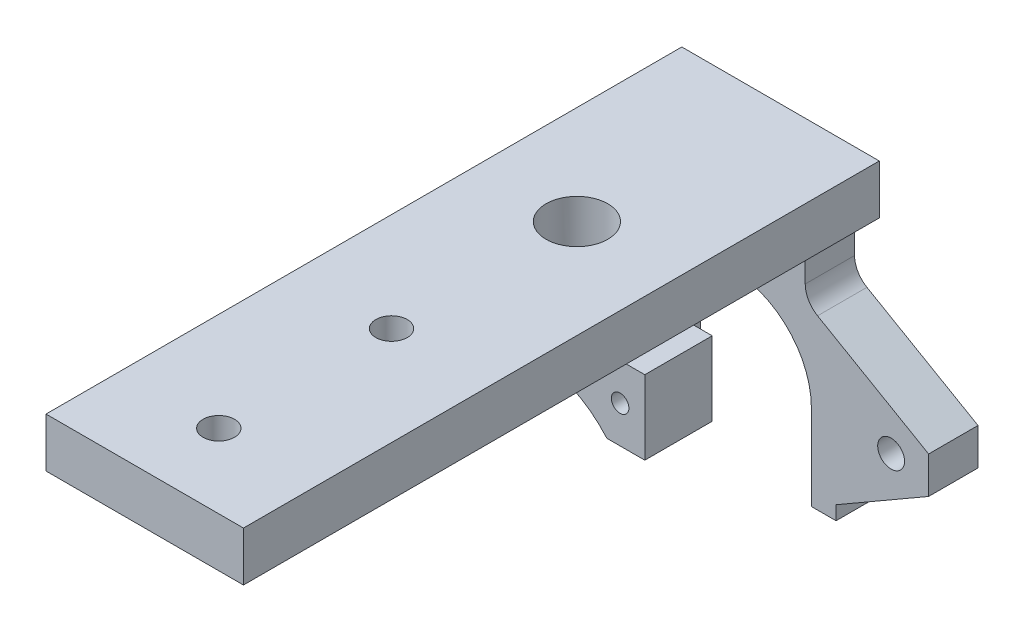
ISO-10303-21;
HEADER;
FILE_DESCRIPTION(('STEP AP214'),'2;1');
FILE_NAME('part.step','',(''),(''),'','','');
FILE_SCHEMA(('AUTOMOTIVE_DESIGN { 1 0 10303 214 1 1 1 1 }'));
ENDSEC;
DATA;
#1=APPLICATION_CONTEXT('core data for automotive mechanical design processes');
#2=APPLICATION_PROTOCOL_DEFINITION('international standard','automotive_design',2000,#1);
#3=PRODUCT_CONTEXT('',#1,'mechanical');
#4=PRODUCT('Part','Part','',(#3));
#5=PRODUCT_RELATED_PRODUCT_CATEGORY('part','',(#4));
#6=PRODUCT_DEFINITION_FORMATION('','',#4);
#7=PRODUCT_DEFINITION_CONTEXT('part definition',#1,'design');
#8=PRODUCT_DEFINITION('design','',#6,#7);
#9=PRODUCT_DEFINITION_SHAPE('','',#8);
#10=(LENGTH_UNIT() NAMED_UNIT(*) SI_UNIT(.MILLI.,.METRE.));
#11=(NAMED_UNIT(*) PLANE_ANGLE_UNIT() SI_UNIT($,.RADIAN.));
#12=(NAMED_UNIT(*) SI_UNIT($,.STERADIAN.) SOLID_ANGLE_UNIT());
#13=UNCERTAINTY_MEASURE_WITH_UNIT(LENGTH_MEASURE(1.E-05),#10,'distance_accuracy_value','');
#14=(GEOMETRIC_REPRESENTATION_CONTEXT(3) GLOBAL_UNCERTAINTY_ASSIGNED_CONTEXT((#13)) GLOBAL_UNIT_ASSIGNED_CONTEXT((#10,
#11,#12)) REPRESENTATION_CONTEXT('',''));
#15=CARTESIAN_POINT('',(0.,0.,0.));
#16=DIRECTION('',(0.,0.,1.));
#17=DIRECTION('',(1.,0.,0.));
#18=AXIS2_PLACEMENT_3D('',#15,#16,#17);
#19=CARTESIAN_POINT('',(25.4,0.,0.));
#20=DIRECTION('',(0.,0.,1.));
#21=DIRECTION('',(0.,-1.,0.));
#22=AXIS2_PLACEMENT_3D('',#19,#20,#21);
#23=PLANE('',#22);
#24=CARTESIAN_POINT('',(20.5739960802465,-25.4889,0.));
#25=DIRECTION('',(0.,0.,-1.));
#26=DIRECTION('',(0.,1.,0.));
#27=AXIS2_PLACEMENT_3D('',#24,#25,#26);
#28=CIRCLE('',#27,1.72719999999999);
#29=CARTESIAN_POINT('',(20.5739960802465,-23.7617,0.));
#30=VERTEX_POINT('',#29);
#31=EDGE_CURVE('E557',#30,#30,#28,.T.);
#32=ORIENTED_EDGE('',*,*,#31,.F.);
#33=EDGE_LOOP('',(#32));
#34=FACE_BOUND('',#33,.T.);
#35=CARTESIAN_POINT('',(-20.5740039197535,-25.4889,0.));
#36=DIRECTION('',(0.,0.,-1.));
#37=DIRECTION('',(0.,1.,0.));
#38=AXIS2_PLACEMENT_3D('',#35,#36,#37);
#39=CIRCLE('',#38,1.72719999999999);
#40=CARTESIAN_POINT('',(-20.5740039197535,-23.7617,0.));
#41=VERTEX_POINT('',#40);
#42=EDGE_CURVE('E560',#41,#41,#39,.T.);
#43=ORIENTED_EDGE('',*,*,#42,.F.);
#44=EDGE_LOOP('',(#43));
#45=FACE_BOUND('',#44,.T.);
#46=DIRECTION('',(-0.866025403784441,0.499999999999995,0.));
#47=VECTOR('',#46,1.);
#48=CARTESIAN_POINT('',(-25.4,-27.8511,0.));
#49=LINE('',#48,#47);
#50=CARTESIAN_POINT('',(-13.49375,-34.7251766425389,0.));
#51=VERTEX_POINT('',#50);
#52=CARTESIAN_POINT('',(-25.4,-27.8511,0.));
#53=VERTEX_POINT('',#52);
#54=EDGE_CURVE('E266',#51,#53,#49,.T.);
#55=ORIENTED_EDGE('',*,*,#54,.T.);
#56=DIRECTION('',(0.,1.,0.));
#57=VECTOR('',#56,1.);
#58=CARTESIAN_POINT('',(-25.4,0.,0.));
#59=LINE('',#58,#57);
#60=CARTESIAN_POINT('',(-25.4,-23.1174572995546,0.));
#61=VERTEX_POINT('',#60);
#62=EDGE_CURVE('E274',#53,#61,#59,.T.);
#63=ORIENTED_EDGE('',*,*,#62,.T.);
#64=DIRECTION('',(0.866025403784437,0.500000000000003,0.));
#65=VECTOR('',#64,1.);
#66=CARTESIAN_POINT('',(-25.4,-23.1174572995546,0.));
#67=LINE('',#66,#65);
#68=CARTESIAN_POINT('',(-11.1125,-14.8685653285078,0.));
#69=VERTEX_POINT('',#68);
#70=EDGE_CURVE('E390',#61,#69,#67,.T.);
#71=ORIENTED_EDGE('',*,*,#70,.T.);
#72=CARTESIAN_POINT('',(-12.7,-12.1189346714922,0.));
#73=DIRECTION('',(0.,0.,1.));
#74=DIRECTION('',(1.,0.,0.));
#75=AXIS2_PLACEMENT_3D('',#72,#73,#74);
#76=CIRCLE('',#75,3.17500000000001);
#77=CARTESIAN_POINT('',(-9.525,-12.1189346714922,0.));
#78=VERTEX_POINT('',#77);
#79=EDGE_CURVE('E393',#69,#78,#76,.T.);
#80=ORIENTED_EDGE('',*,*,#79,.T.);
#81=DIRECTION('',(0.,1.,0.));
#82=VECTOR('',#81,1.);
#83=CARTESIAN_POINT('',(-9.52500000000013,-9.525,0.));
#84=LINE('',#83,#82);
#85=CARTESIAN_POINT('',(-9.52500000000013,-9.525,0.));
#86=VERTEX_POINT('',#85);
#87=EDGE_CURVE('E396',#78,#86,#84,.T.);
#88=ORIENTED_EDGE('',*,*,#87,.T.);
#89=CARTESIAN_POINT('',(-12.7000000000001,-9.525,0.));
#90=DIRECTION('',(0.,0.,1.));
#91=DIRECTION('',(1.,0.,0.));
#92=AXIS2_PLACEMENT_3D('',#89,#90,#91);
#93=CIRCLE('',#92,3.175);
#94=CARTESIAN_POINT('',(-12.7,-6.35,0.));
#95=VERTEX_POINT('',#94);
#96=EDGE_CURVE('E399',#86,#95,#93,.T.);
#97=ORIENTED_EDGE('',*,*,#96,.T.);
#98=DIRECTION('',(0.,1.,0.));
#99=VECTOR('',#98,1.);
#100=CARTESIAN_POINT('',(-12.7,0.,0.));
#101=LINE('',#100,#99);
#102=CARTESIAN_POINT('',(-12.7,0.,0.));
#103=VERTEX_POINT('',#102);
#104=EDGE_CURVE('E402',#95,#103,#101,.T.);
#105=ORIENTED_EDGE('',*,*,#104,.T.);
#106=DIRECTION('',(-1.,0.,0.));
#107=VECTOR('',#106,1.);
#108=CARTESIAN_POINT('',(25.4,0.,0.));
#109=LINE('',#108,#107);
#110=CARTESIAN_POINT('',(12.7,0.,0.));
#111=VERTEX_POINT('',#110);
#112=EDGE_CURVE('E11',#111,#103,#109,.T.);
#113=ORIENTED_EDGE('',*,*,#112,.F.);
#114=DIRECTION('',(0.,-1.,0.));
#115=VECTOR('',#114,1.);
#116=CARTESIAN_POINT('',(12.7,0.,0.));
#117=LINE('',#116,#115);
#118=CARTESIAN_POINT('',(12.7,-6.35,0.));
#119=VERTEX_POINT('',#118);
#120=EDGE_CURVE('E442',#111,#119,#117,.T.);
#121=ORIENTED_EDGE('',*,*,#120,.T.);
#122=CARTESIAN_POINT('',(12.7000000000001,-9.525,0.));
#123=DIRECTION('',(0.,0.,1.));
#124=DIRECTION('',(-1.,0.,0.));
#125=AXIS2_PLACEMENT_3D('',#122,#123,#124);
#126=CIRCLE('',#125,3.175);
#127=CARTESIAN_POINT('',(9.52500000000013,-9.525,0.));
#128=VERTEX_POINT('',#127);
#129=EDGE_CURVE('E445',#119,#128,#126,.T.);
#130=ORIENTED_EDGE('',*,*,#129,.T.);
#131=DIRECTION('',(0.,-1.,0.));
#132=VECTOR('',#131,1.);
#133=CARTESIAN_POINT('',(9.52500000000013,-9.525,0.));
#134=LINE('',#133,#132);
#135=CARTESIAN_POINT('',(9.52500000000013,-12.1189346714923,0.));
#136=VERTEX_POINT('',#135);
#137=EDGE_CURVE('E448',#128,#136,#134,.T.);
#138=ORIENTED_EDGE('',*,*,#137,.T.);
#139=CARTESIAN_POINT('',(12.7,-12.1189346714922,0.));
#140=DIRECTION('',(0.,0.,1.));
#141=DIRECTION('',(-1.,0.,0.));
#142=AXIS2_PLACEMENT_3D('',#139,#140,#141);
#143=CIRCLE('',#142,3.17499999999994);
#144=CARTESIAN_POINT('',(11.1125000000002,-14.8685653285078,0.));
#145=VERTEX_POINT('',#144);
#146=EDGE_CURVE('E451',#136,#145,#143,.T.);
#147=ORIENTED_EDGE('',*,*,#146,.T.);
#148=DIRECTION('',(0.866025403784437,-0.500000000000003,0.));
#149=VECTOR('',#148,1.);
#150=CARTESIAN_POINT('',(25.4,-23.1174572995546,0.));
#151=LINE('',#150,#149);
#152=CARTESIAN_POINT('',(25.4,-23.1174572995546,0.));
#153=VERTEX_POINT('',#152);
#154=EDGE_CURVE('E454',#145,#153,#151,.T.);
#155=ORIENTED_EDGE('',*,*,#154,.T.);
#156=DIRECTION('',(0.,1.,0.));
#157=VECTOR('',#156,1.);
#158=CARTESIAN_POINT('',(25.4,0.,0.));
#159=LINE('',#158,#157);
#160=CARTESIAN_POINT('',(25.4,-27.8511,0.));
#161=VERTEX_POINT('',#160);
#162=EDGE_CURVE('E282',#161,#153,#159,.T.);
#163=ORIENTED_EDGE('',*,*,#162,.F.);
#164=DIRECTION('',(-0.866025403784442,-0.499999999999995,0.));
#165=VECTOR('',#164,1.);
#166=CARTESIAN_POINT('',(25.4,-27.8511,0.));
#167=LINE('',#166,#165);
#168=CARTESIAN_POINT('',(13.49375,-34.7251766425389,0.));
#169=VERTEX_POINT('',#168);
#170=EDGE_CURVE('E418',#161,#169,#167,.T.);
#171=ORIENTED_EDGE('',*,*,#170,.T.);
#172=DIRECTION('',(0.,-1.,0.));
#173=VECTOR('',#172,1.);
#174=CARTESIAN_POINT('',(13.49375,-34.7251766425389,0.));
#175=LINE('',#174,#173);
#176=CARTESIAN_POINT('',(13.49375,-36.5125,0.));
#177=VERTEX_POINT('',#176);
#178=EDGE_CURVE('E421',#169,#177,#175,.T.);
#179=ORIENTED_EDGE('',*,*,#178,.T.);
#180=DIRECTION('',(-1.,0.,0.));
#181=VECTOR('',#180,1.);
#182=CARTESIAN_POINT('',(25.4,-36.5125,0.));
#183=LINE('',#182,#181);
#184=CARTESIAN_POINT('',(10.31875,-36.5125,0.));
#185=VERTEX_POINT('',#184);
#186=EDGE_CURVE('E290',#177,#185,#183,.T.);
#187=ORIENTED_EDGE('',*,*,#186,.T.);
#188=DIRECTION('',(0.,-1.,0.));
#189=VECTOR('',#188,1.);
#190=CARTESIAN_POINT('',(10.31875,-25.5016,0.));
#191=LINE('',#190,#189);
#192=CARTESIAN_POINT('',(10.31875,-25.5016,0.));
#193=VERTEX_POINT('',#192);
#194=EDGE_CURVE('E350',#193,#185,#191,.T.);
#195=ORIENTED_EDGE('',*,*,#194,.F.);
#196=CARTESIAN_POINT('',(0.,-25.5016,0.));
#197=DIRECTION('',(0.,0.,-1.));
#198=DIRECTION('',(0.,1.,0.));
#199=AXIS2_PLACEMENT_3D('',#196,#197,#198);
#200=CIRCLE('',#199,10.31875);
#201=CARTESIAN_POINT('',(-10.31875,-25.5016,0.));
#202=VERTEX_POINT('',#201);
#203=EDGE_CURVE('E347',#202,#193,#200,.T.);
#204=ORIENTED_EDGE('',*,*,#203,.F.);
#205=DIRECTION('',(0.,1.,0.));
#206=VECTOR('',#205,1.);
#207=CARTESIAN_POINT('',(-10.31875,-25.5016,0.));
#208=LINE('',#207,#206);
#209=CARTESIAN_POINT('',(-10.31875,-36.5125,0.));
#210=VERTEX_POINT('',#209);
#211=EDGE_CURVE('E353',#210,#202,#208,.T.);
#212=ORIENTED_EDGE('',*,*,#211,.F.);
#213=CARTESIAN_POINT('',(-13.49375,-36.5125,0.));
#214=VERTEX_POINT('',#213);
#215=EDGE_CURVE('E293',#210,#214,#183,.T.);
#216=ORIENTED_EDGE('',*,*,#215,.T.);
#217=DIRECTION('',(0.,1.,0.));
#218=VECTOR('',#217,1.);
#219=CARTESIAN_POINT('',(-13.49375,-34.7251766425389,0.));
#220=LINE('',#219,#218);
#221=EDGE_CURVE('E55',#214,#51,#220,.T.);
#222=ORIENTED_EDGE('',*,*,#221,.T.);
#223=EDGE_LOOP('',(#55,#63,#71,#80,#88,#97,#105,#113,#121,#130,#138,#147,#155,#163,#171,#179,
#187,#195,#204,#212,#216,#222));
#224=FACE_BOUND('',#223,.T.);
#225=ADVANCED_FACE('F41',(#34,#45,#224),#23,.F.);
#226=CARTESIAN_POINT('',(25.4,-6.35,6.35));
#227=DIRECTION('',(0.,0.,-1.));
#228=DIRECTION('',(0.,1.,0.));
#229=AXIS2_PLACEMENT_3D('',#226,#227,#228);
#230=PLANE('',#229);
#231=CARTESIAN_POINT('',(20.5739960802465,-25.4889,6.35));
#232=DIRECTION('',(0.,0.,-1.));
#233=DIRECTION('',(0.,1.,0.));
#234=AXIS2_PLACEMENT_3D('',#231,#232,#233);
#235=CIRCLE('',#234,1.72719999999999);
#236=CARTESIAN_POINT('',(20.5739960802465,-23.7617,6.35));
#237=VERTEX_POINT('',#236);
#238=EDGE_CURVE('E563',#237,#237,#235,.T.);
#239=ORIENTED_EDGE('',*,*,#238,.T.);
#240=EDGE_LOOP('',(#239));
#241=FACE_BOUND('',#240,.T.);
#242=CARTESIAN_POINT('',(-20.5740039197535,-25.4889,6.35));
#243=DIRECTION('',(0.,0.,-1.));
#244=DIRECTION('',(0.,1.,0.));
#245=AXIS2_PLACEMENT_3D('',#242,#243,#244);
#246=CIRCLE('',#245,1.72719999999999);
#247=CARTESIAN_POINT('',(-20.5740039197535,-23.7617,6.35));
#248=VERTEX_POINT('',#247);
#249=EDGE_CURVE('E562',#248,#248,#246,.T.);
#250=ORIENTED_EDGE('',*,*,#249,.T.);
#251=EDGE_LOOP('',(#250));
#252=FACE_BOUND('',#251,.T.);
#253=DIRECTION('',(0.866025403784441,-0.499999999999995,0.));
#254=VECTOR('',#253,1.);
#255=CARTESIAN_POINT('',(-25.4,-27.8511,6.34999999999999));
#256=LINE('',#255,#254);
#257=CARTESIAN_POINT('',(-25.4,-27.8511,6.35));
#258=VERTEX_POINT('',#257);
#259=CARTESIAN_POINT('',(-13.49375,-34.7251766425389,6.34999999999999));
#260=VERTEX_POINT('',#259);
#261=EDGE_CURVE('E256',#258,#260,#256,.T.);
#262=ORIENTED_EDGE('',*,*,#261,.T.);
#263=DIRECTION('',(0.,-1.,0.));
#264=VECTOR('',#263,1.);
#265=CARTESIAN_POINT('',(-13.49375,-34.7251766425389,6.34999999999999));
#266=LINE('',#265,#264);
#267=CARTESIAN_POINT('',(-13.49375,-36.5125,6.34999999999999));
#268=VERTEX_POINT('',#267);
#269=EDGE_CURVE('E275',#260,#268,#266,.T.);
#270=ORIENTED_EDGE('',*,*,#269,.T.);
#271=DIRECTION('',(-1.,0.,0.));
#272=VECTOR('',#271,1.);
#273=CARTESIAN_POINT('',(25.4,-36.5125,6.35));
#274=LINE('',#273,#272);
#275=CARTESIAN_POINT('',(-10.31875,-36.5125,6.34999999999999));
#276=VERTEX_POINT('',#275);
#277=EDGE_CURVE('E292',#276,#268,#274,.T.);
#278=ORIENTED_EDGE('',*,*,#277,.F.);
#279=DIRECTION('',(0.,-1.,0.));
#280=VECTOR('',#279,1.);
#281=CARTESIAN_POINT('',(-10.31875,-25.5016,6.34999999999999));
#282=LINE('',#281,#280);
#283=CARTESIAN_POINT('',(-10.31875,-25.5016,6.34999999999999));
#284=VERTEX_POINT('',#283);
#285=EDGE_CURVE('E345',#284,#276,#282,.T.);
#286=ORIENTED_EDGE('',*,*,#285,.F.);
#287=CARTESIAN_POINT('',(0.,-25.5016,6.34999999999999));
#288=DIRECTION('',(0.,0.,-1.));
#289=DIRECTION('',(0.,1.,0.));
#290=AXIS2_PLACEMENT_3D('',#287,#288,#289);
#291=CIRCLE('',#290,10.31875);
#292=CARTESIAN_POINT('',(10.31875,-25.5016,6.34999999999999));
#293=VERTEX_POINT('',#292);
#294=EDGE_CURVE('E342',#293,#284,#291,.F.);
#295=ORIENTED_EDGE('',*,*,#294,.F.);
#296=DIRECTION('',(0.,1.,0.));
#297=VECTOR('',#296,1.);
#298=CARTESIAN_POINT('',(10.31875,-25.5016,6.34999999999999));
#299=LINE('',#298,#297);
#300=CARTESIAN_POINT('',(10.31875,-36.5125,6.34999999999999));
#301=VERTEX_POINT('',#300);
#302=EDGE_CURVE('E286',#301,#293,#299,.T.);
#303=ORIENTED_EDGE('',*,*,#302,.F.);
#304=CARTESIAN_POINT('',(13.49375,-36.5125,6.35));
#305=VERTEX_POINT('',#304);
#306=EDGE_CURVE('E294',#305,#301,#274,.T.);
#307=ORIENTED_EDGE('',*,*,#306,.F.);
#308=DIRECTION('',(0.,1.,0.));
#309=VECTOR('',#308,1.);
#310=CARTESIAN_POINT('',(13.49375,-34.7251766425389,6.34999999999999));
#311=LINE('',#310,#309);
#312=CARTESIAN_POINT('',(13.49375,-34.7251766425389,6.34999999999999));
#313=VERTEX_POINT('',#312);
#314=EDGE_CURVE('E63',#305,#313,#311,.T.);
#315=ORIENTED_EDGE('',*,*,#314,.T.);
#316=DIRECTION('',(0.866025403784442,0.499999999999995,0.));
#317=VECTOR('',#316,1.);
#318=CARTESIAN_POINT('',(25.4,-27.8511,6.34999999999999));
#319=LINE('',#318,#317);
#320=CARTESIAN_POINT('',(25.4,-27.8511,6.35));
#321=VERTEX_POINT('',#320);
#322=EDGE_CURVE('E415',#313,#321,#319,.T.);
#323=ORIENTED_EDGE('',*,*,#322,.T.);
#324=DIRECTION('',(0.,-1.,0.));
#325=VECTOR('',#324,1.);
#326=CARTESIAN_POINT('',(25.4,-6.35,6.35));
#327=LINE('',#326,#325);
#328=CARTESIAN_POINT('',(25.4,-23.1174572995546,6.34999999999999));
#329=VERTEX_POINT('',#328);
#330=EDGE_CURVE('E284',#329,#321,#327,.T.);
#331=ORIENTED_EDGE('',*,*,#330,.F.);
#332=DIRECTION('',(-0.866025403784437,0.500000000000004,0.));
#333=VECTOR('',#332,1.);
#334=CARTESIAN_POINT('',(25.4,-23.1174572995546,6.34999999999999));
#335=LINE('',#334,#333);
#336=CARTESIAN_POINT('',(11.1125000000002,-14.8685653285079,6.35));
#337=VERTEX_POINT('',#336);
#338=EDGE_CURVE('E430',#329,#337,#335,.T.);
#339=ORIENTED_EDGE('',*,*,#338,.T.);
#340=CARTESIAN_POINT('',(12.7,-12.1189346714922,6.34999999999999));
#341=DIRECTION('',(0.,0.,-1.));
#342=DIRECTION('',(0.,1.,0.));
#343=AXIS2_PLACEMENT_3D('',#340,#341,#342);
#344=CIRCLE('',#343,3.17499999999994);
#345=CARTESIAN_POINT('',(9.52500000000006,-12.1189346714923,6.34999999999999));
#346=VERTEX_POINT('',#345);
#347=EDGE_CURVE('E433',#337,#346,#344,.T.);
#348=ORIENTED_EDGE('',*,*,#347,.T.);
#349=DIRECTION('',(0.,1.,0.));
#350=VECTOR('',#349,1.);
#351=CARTESIAN_POINT('',(9.52500000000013,-9.52499999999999,6.34999999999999));
#352=LINE('',#351,#350);
#353=CARTESIAN_POINT('',(9.52500000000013,-9.525,6.34999999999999));
#354=VERTEX_POINT('',#353);
#355=EDGE_CURVE('E436',#346,#354,#352,.T.);
#356=ORIENTED_EDGE('',*,*,#355,.T.);
#357=CARTESIAN_POINT('',(12.7000000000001,-9.525,6.34999999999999));
#358=DIRECTION('',(0.,0.,-1.));
#359=DIRECTION('',(0.,1.,0.));
#360=AXIS2_PLACEMENT_3D('',#357,#358,#359);
#361=CIRCLE('',#360,3.175);
#362=CARTESIAN_POINT('',(12.7,-6.35,6.35));
#363=VERTEX_POINT('',#362);
#364=EDGE_CURVE('E439',#354,#363,#361,.T.);
#365=ORIENTED_EDGE('',*,*,#364,.T.);
#366=DIRECTION('',(-1.,0.,0.));
#367=VECTOR('',#366,1.);
#368=CARTESIAN_POINT('',(25.4,-6.35,6.35));
#369=LINE('',#368,#367);
#370=CARTESIAN_POINT('',(-12.7,-6.35,6.35));
#371=VERTEX_POINT('',#370);
#372=EDGE_CURVE('E296',#363,#371,#369,.T.);
#373=ORIENTED_EDGE('',*,*,#372,.T.);
#374=CARTESIAN_POINT('',(-12.7000000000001,-9.525,6.34999999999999));
#375=DIRECTION('',(0.,0.,-1.));
#376=DIRECTION('',(0.,1.,0.));
#377=AXIS2_PLACEMENT_3D('',#374,#375,#376);
#378=CIRCLE('',#377,3.175);
#379=CARTESIAN_POINT('',(-9.52500000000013,-9.525,6.34999999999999));
#380=VERTEX_POINT('',#379);
#381=EDGE_CURVE('E381',#371,#380,#378,.T.);
#382=ORIENTED_EDGE('',*,*,#381,.T.);
#383=DIRECTION('',(0.,-1.,0.));
#384=VECTOR('',#383,1.);
#385=CARTESIAN_POINT('',(-9.52500000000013,-9.52499999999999,6.34999999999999));
#386=LINE('',#385,#384);
#387=CARTESIAN_POINT('',(-9.525,-12.1189346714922,6.34999999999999));
#388=VERTEX_POINT('',#387);
#389=EDGE_CURVE('E384',#380,#388,#386,.T.);
#390=ORIENTED_EDGE('',*,*,#389,.T.);
#391=CARTESIAN_POINT('',(-12.7,-12.1189346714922,6.34999999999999));
#392=DIRECTION('',(0.,0.,-1.));
#393=DIRECTION('',(0.,1.,0.));
#394=AXIS2_PLACEMENT_3D('',#391,#392,#393);
#395=CIRCLE('',#394,3.17500000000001);
#396=CARTESIAN_POINT('',(-11.1125,-14.8685653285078,6.34999999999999));
#397=VERTEX_POINT('',#396);
#398=EDGE_CURVE('E387',#388,#397,#395,.T.);
#399=ORIENTED_EDGE('',*,*,#398,.T.);
#400=DIRECTION('',(-0.866025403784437,-0.500000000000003,0.));
#401=VECTOR('',#400,1.);
#402=CARTESIAN_POINT('',(-25.4,-23.1174572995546,6.34999999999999));
#403=LINE('',#402,#401);
#404=CARTESIAN_POINT('',(-25.4,-23.1174572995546,6.35));
#405=VERTEX_POINT('',#404);
#406=EDGE_CURVE('E281',#397,#405,#403,.T.);
#407=ORIENTED_EDGE('',*,*,#406,.T.);
#408=DIRECTION('',(0.,-1.,0.));
#409=VECTOR('',#408,1.);
#410=CARTESIAN_POINT('',(-25.4,-6.35,6.35));
#411=LINE('',#410,#409);
#412=EDGE_CURVE('E273',#405,#258,#411,.T.);
#413=ORIENTED_EDGE('',*,*,#412,.T.);
#414=EDGE_LOOP('',(#262,#270,#278,#286,#295,#303,#307,#315,#323,#331,#339,#348,#356,#365,#373,
#382,#390,#399,#407,#413));
#415=FACE_BOUND('',#414,.T.);
#416=ADVANCED_FACE('F279',(#241,#252,#415),#230,.F.);
#417=CARTESIAN_POINT('',(-25.4,0.,0.));
#418=DIRECTION('',(-1.,0.,0.));
#419=DIRECTION('',(0.,0.,1.));
#420=AXIS2_PLACEMENT_3D('',#417,#418,#419);
#421=PLANE('',#420);
#422=ORIENTED_EDGE('',*,*,#62,.F.);
#423=DIRECTION('',(0.,0.,-1.));
#424=VECTOR('',#423,1.);
#425=CARTESIAN_POINT('',(-25.4,-27.8511,81.789));
#426=LINE('',#425,#424);
#427=EDGE_CURVE('E260',#258,#53,#426,.T.);
#428=ORIENTED_EDGE('',*,*,#427,.F.);
#429=ORIENTED_EDGE('',*,*,#412,.F.);
#430=DIRECTION('',(0.,0.,-1.));
#431=VECTOR('',#430,1.);
#432=CARTESIAN_POINT('',(-25.4,-23.1174572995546,81.789));
#433=LINE('',#432,#431);
#434=EDGE_CURVE('E412',#405,#61,#433,.T.);
#435=ORIENTED_EDGE('',*,*,#434,.T.);
#436=EDGE_LOOP('',(#422,#428,#429,#435));
#437=FACE_BOUND('',#436,.T.);
#438=ADVANCED_FACE('F271',(#437),#421,.T.);
#439=CARTESIAN_POINT('',(25.4,-36.5125,6.35));
#440=DIRECTION('',(0.,1.,0.));
#441=DIRECTION('',(0.,0.,1.));
#442=AXIS2_PLACEMENT_3D('',#439,#440,#441);
#443=PLANE('',#442);
#444=DIRECTION('',(0.,0.,-1.));
#445=VECTOR('',#444,1.);
#446=CARTESIAN_POINT('',(-13.49375,-36.5125,81.789));
#447=LINE('',#446,#445);
#448=EDGE_CURVE('E276',#268,#214,#447,.T.);
#449=ORIENTED_EDGE('',*,*,#448,.T.);
#450=ORIENTED_EDGE('',*,*,#215,.F.);
#451=DIRECTION('',(0.,0.,-1.));
#452=VECTOR('',#451,1.);
#453=CARTESIAN_POINT('',(-10.31875,-36.5125,81.789));
#454=LINE('',#453,#452);
#455=EDGE_CURVE('E340',#276,#210,#454,.T.);
#456=ORIENTED_EDGE('',*,*,#455,.F.);
#457=ORIENTED_EDGE('',*,*,#277,.T.);
#458=EDGE_LOOP('',(#449,#450,#456,#457));
#459=FACE_BOUND('',#458,.T.);
#460=ADVANCED_FACE('F373',(#459),#443,.F.);
#461=CARTESIAN_POINT('',(25.4,0.,0.));
#462=DIRECTION('',(0.,-1.,0.));
#463=DIRECTION('',(0.,0.,-1.));
#464=AXIS2_PLACEMENT_3D('',#461,#462,#463);
#465=PLANE('',#464);
#466=CARTESIAN_POINT('',(0.,0.,72.263));
#467=DIRECTION('',(0.,1.,0.));
#468=DIRECTION('',(0.,0.,1.));
#469=AXIS2_PLACEMENT_3D('',#466,#467,#468);
#470=CIRCLE('',#469,2.0193);
#471=CARTESIAN_POINT('',(0.,0.,74.2823));
#472=VERTEX_POINT('',#471);
#473=EDGE_CURVE('E468',#472,#472,#470,.T.);
#474=ORIENTED_EDGE('',*,*,#473,.F.);
#475=EDGE_LOOP('',(#474));
#476=FACE_BOUND('',#475,.T.);
#477=CARTESIAN_POINT('',(0.,0.,50.038));
#478=DIRECTION('',(0.,1.,0.));
#479=DIRECTION('',(0.,0.,1.));
#480=AXIS2_PLACEMENT_3D('',#477,#478,#479);
#481=CIRCLE('',#480,2.0193);
#482=CARTESIAN_POINT('',(0.,0.,52.0573));
#483=VERTEX_POINT('',#482);
#484=EDGE_CURVE('E474',#483,#483,#481,.T.);
#485=ORIENTED_EDGE('',*,*,#484,.F.);
#486=EDGE_LOOP('',(#485));
#487=FACE_BOUND('',#486,.T.);
#488=CARTESIAN_POINT('',(0.,0.,26.19375));
#489=DIRECTION('',(0.,-1.,0.));
#490=DIRECTION('',(0.,0.,-1.));
#491=AXIS2_PLACEMENT_3D('',#488,#489,#490);
#492=CIRCLE('',#491,3.96875);
#493=CARTESIAN_POINT('',(0.,0.,22.225));
#494=VERTEX_POINT('',#493);
#495=EDGE_CURVE('E688',#494,#494,#492,.F.);
#496=ORIENTED_EDGE('',*,*,#495,.F.);
#497=EDGE_LOOP('',(#496));
#498=FACE_BOUND('',#497,.T.);
#499=ORIENTED_EDGE('',*,*,#112,.T.);
#500=DIRECTION('',(0.,0.,1.));
#501=VECTOR('',#500,1.);
#502=CARTESIAN_POINT('',(-12.7,0.,81.788));
#503=LINE('',#502,#501);
#504=CARTESIAN_POINT('',(-12.7,0.,81.788));
#505=VERTEX_POINT('',#504);
#506=EDGE_CURVE('E315',#103,#505,#503,.T.);
#507=ORIENTED_EDGE('',*,*,#506,.T.);
#508=DIRECTION('',(-1.,0.,0.));
#509=VECTOR('',#508,1.);
#510=CARTESIAN_POINT('',(25.4,0.,81.788));
#511=LINE('',#510,#509);
#512=CARTESIAN_POINT('',(12.7,0.,81.788));
#513=VERTEX_POINT('',#512);
#514=EDGE_CURVE('E48',#513,#505,#511,.T.);
#515=ORIENTED_EDGE('',*,*,#514,.F.);
#516=DIRECTION('',(0.,0.,-1.));
#517=VECTOR('',#516,1.);
#518=CARTESIAN_POINT('',(12.7,0.,81.788));
#519=LINE('',#518,#517);
#520=EDGE_CURVE('E313',#513,#111,#519,.T.);
#521=ORIENTED_EDGE('',*,*,#520,.T.);
#522=EDGE_LOOP('',(#499,#507,#515,#521));
#523=FACE_BOUND('',#522,.T.);
#524=ADVANCED_FACE('F312',(#476,#487,#498,#523),#465,.F.);
#525=CARTESIAN_POINT('',(25.4,0.,0.));
#526=DIRECTION('',(-1.,0.,0.));
#527=DIRECTION('',(0.,0.,1.));
#528=AXIS2_PLACEMENT_3D('',#525,#526,#527);
#529=PLANE('',#528);
#530=DIRECTION('',(0.,0.,-1.));
#531=VECTOR('',#530,1.);
#532=CARTESIAN_POINT('',(25.4,-27.8511,81.789));
#533=LINE('',#532,#531);
#534=EDGE_CURVE('E428',#321,#161,#533,.T.);
#535=ORIENTED_EDGE('',*,*,#534,.T.);
#536=ORIENTED_EDGE('',*,*,#162,.T.);
#537=DIRECTION('',(0.,0.,-1.));
#538=VECTOR('',#537,1.);
#539=CARTESIAN_POINT('',(25.4,-23.1174572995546,81.789));
#540=LINE('',#539,#538);
#541=EDGE_CURVE('E457',#329,#153,#540,.T.);
#542=ORIENTED_EDGE('',*,*,#541,.F.);
#543=ORIENTED_EDGE('',*,*,#330,.T.);
#544=EDGE_LOOP('',(#535,#536,#542,#543));
#545=FACE_BOUND('',#544,.T.);
#546=ADVANCED_FACE('F753',(#545),#529,.F.);
#547=DIRECTION('',(0.,0.,-1.));
#548=VECTOR('',#547,1.);
#549=CARTESIAN_POINT('',(13.49375,-36.5125,81.789));
#550=LINE('',#549,#548);
#551=EDGE_CURVE('E424',#305,#177,#550,.T.);
#552=ORIENTED_EDGE('',*,*,#551,.F.);
#553=ORIENTED_EDGE('',*,*,#306,.T.);
#554=DIRECTION('',(0.,0.,1.));
#555=VECTOR('',#554,1.);
#556=CARTESIAN_POINT('',(10.31875,-36.5125,81.789));
#557=LINE('',#556,#555);
#558=EDGE_CURVE('E337',#185,#301,#557,.T.);
#559=ORIENTED_EDGE('',*,*,#558,.F.);
#560=ORIENTED_EDGE('',*,*,#186,.F.);
#561=EDGE_LOOP('',(#552,#553,#559,#560));
#562=FACE_BOUND('',#561,.T.);
#563=ADVANCED_FACE('F756',(#562),#443,.F.);
#564=CARTESIAN_POINT('',(15.08125,-6.35000000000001,23.86965));
#565=DIRECTION('',(0.,0.,1.));
#566=DIRECTION('',(1.,0.,0.));
#567=AXIS2_PLACEMENT_3D('',#564,#565,#566);
#568=PLANE('',#567);
#569=CARTESIAN_POINT('',(-11.90625,-11.1125,23.86965));
#570=DIRECTION('',(0.,0.,1.));
#571=DIRECTION('',(1.,0.,0.));
#572=AXIS2_PLACEMENT_3D('',#569,#570,#571);
#573=CIRCLE('',#572,1.13029999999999);
#574=CARTESIAN_POINT('',(-10.77595,-11.1125,23.86965));
#575=VERTEX_POINT('',#574);
#576=EDGE_CURVE('E574',#575,#575,#573,.T.);
#577=ORIENTED_EDGE('',*,*,#576,.T.);
#578=EDGE_LOOP('',(#577));
#579=FACE_BOUND('',#578,.T.);
#580=DIRECTION('',(-1.,0.,0.));
#581=VECTOR('',#580,1.);
#582=CARTESIAN_POINT('',(15.08125,-6.35000000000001,23.86965));
#583=LINE('',#582,#581);
#584=CARTESIAN_POINT('',(-3.21706943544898,-6.35000000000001,23.86965));
#585=VERTEX_POINT('',#584);
#586=CARTESIAN_POINT('',(-12.7,-6.35000000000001,23.86965));
#587=VERTEX_POINT('',#586);
#588=EDGE_CURVE('E630',#585,#587,#583,.T.);
#589=ORIENTED_EDGE('',*,*,#588,.F.);
#590=DIRECTION('',(0.,-1.,0.));
#591=VECTOR('',#590,1.);
#592=CARTESIAN_POINT('',(-3.21706943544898,0.00100000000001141,23.86965));
#593=LINE('',#592,#591);
#594=CARTESIAN_POINT('',(-3.21706943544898,-11.6032037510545,23.86965));
#595=VERTEX_POINT('',#594);
#596=EDGE_CURVE('E687',#595,#585,#593,.F.);
#597=ORIENTED_EDGE('',*,*,#596,.F.);
#598=CARTESIAN_POINT('',(0.,-24.70785,23.86965));
#599=DIRECTION('',(0.,0.,1.));
#600=DIRECTION('',(1.,0.,0.));
#601=AXIS2_PLACEMENT_3D('',#598,#599,#600);
#602=CIRCLE('',#601,13.49375);
#603=CARTESIAN_POINT('',(-10.2010808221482,-15.875,23.86965));
#604=VERTEX_POINT('',#603);
#605=EDGE_CURVE('E590',#604,#595,#602,.F.);
#606=ORIENTED_EDGE('',*,*,#605,.F.);
#607=DIRECTION('',(-1.,0.,0.));
#608=VECTOR('',#607,1.);
#609=CARTESIAN_POINT('',(15.08125,-15.875,23.86965));
#610=LINE('',#609,#608);
#611=CARTESIAN_POINT('',(-15.08125,-15.875,23.86965));
#612=VERTEX_POINT('',#611);
#613=EDGE_CURVE('E614',#604,#612,#610,.T.);
#614=ORIENTED_EDGE('',*,*,#613,.T.);
#615=DIRECTION('',(0.,1.,0.));
#616=VECTOR('',#615,1.);
#617=CARTESIAN_POINT('',(-15.08125,-6.35000000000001,23.86965));
#618=LINE('',#617,#616);
#619=CARTESIAN_POINT('',(-15.08125,-6.35000000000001,23.86965));
#620=VERTEX_POINT('',#619);
#621=EDGE_CURVE('E593',#612,#620,#618,.T.);
#622=ORIENTED_EDGE('',*,*,#621,.T.);
#623=EDGE_CURVE('E625',#587,#620,#583,.T.);
#624=ORIENTED_EDGE('',*,*,#623,.F.);
#625=EDGE_LOOP('',(#589,#597,#606,#614,#622,#624));
#626=FACE_BOUND('',#625,.T.);
#627=ADVANCED_FACE('F652',(#579,#626),#568,.F.);
#628=CARTESIAN_POINT('',(15.08125,-6.35000000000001,32.54375));
#629=DIRECTION('',(0.,0.,-1.));
#630=DIRECTION('',(-1.,0.,0.));
#631=AXIS2_PLACEMENT_3D('',#628,#629,#630);
#632=PLANE('',#631);
#633=CARTESIAN_POINT('',(11.90625,-11.1125,32.54375));
#634=DIRECTION('',(0.,0.,1.));
#635=DIRECTION('',(1.,0.,0.));
#636=AXIS2_PLACEMENT_3D('',#633,#634,#635);
#637=CIRCLE('',#636,1.13029999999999);
#638=CARTESIAN_POINT('',(13.03655,-11.1125,32.54375));
#639=VERTEX_POINT('',#638);
#640=EDGE_CURVE('E577',#639,#639,#637,.T.);
#641=ORIENTED_EDGE('',*,*,#640,.F.);
#642=EDGE_LOOP('',(#641));
#643=FACE_BOUND('',#642,.T.);
#644=DIRECTION('',(-1.,0.,0.));
#645=VECTOR('',#644,1.);
#646=CARTESIAN_POINT('',(15.08125,-15.875,32.54375));
#647=LINE('',#646,#645);
#648=CARTESIAN_POINT('',(-10.2010808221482,-15.875,32.54375));
#649=VERTEX_POINT('',#648);
#650=CARTESIAN_POINT('',(-15.08125,-15.875,32.54375));
#651=VERTEX_POINT('',#650);
#652=EDGE_CURVE('E618',#649,#651,#647,.T.);
#653=ORIENTED_EDGE('',*,*,#652,.F.);
#654=CARTESIAN_POINT('',(0.,-24.70785,32.54375));
#655=DIRECTION('',(0.,0.,1.));
#656=DIRECTION('',(1.,0.,0.));
#657=AXIS2_PLACEMENT_3D('',#654,#655,#656);
#658=CIRCLE('',#657,13.49375);
#659=CARTESIAN_POINT('',(10.2010808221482,-15.875,32.54375));
#660=VERTEX_POINT('',#659);
#661=EDGE_CURVE('E587',#660,#649,#658,.T.);
#662=ORIENTED_EDGE('',*,*,#661,.F.);
#663=CARTESIAN_POINT('',(15.08125,-15.875,32.54375));
#664=VERTEX_POINT('',#663);
#665=EDGE_CURVE('E619',#664,#660,#647,.T.);
#666=ORIENTED_EDGE('',*,*,#665,.F.);
#667=DIRECTION('',(0.,-1.,0.));
#668=VECTOR('',#667,1.);
#669=CARTESIAN_POINT('',(15.08125,-6.35000000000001,32.54375));
#670=LINE('',#669,#668);
#671=CARTESIAN_POINT('',(15.08125,-6.35000000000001,32.54375));
#672=VERTEX_POINT('',#671);
#673=EDGE_CURVE('E610',#672,#664,#670,.T.);
#674=ORIENTED_EDGE('',*,*,#673,.F.);
#675=DIRECTION('',(-1.,0.,0.));
#676=VECTOR('',#675,1.);
#677=CARTESIAN_POINT('',(15.08125,-6.35000000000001,32.54375));
#678=LINE('',#677,#676);
#679=CARTESIAN_POINT('',(12.7,-6.35000000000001,32.54375));
#680=VERTEX_POINT('',#679);
#681=EDGE_CURVE('E623',#672,#680,#678,.T.);
#682=ORIENTED_EDGE('',*,*,#681,.T.);
#683=CARTESIAN_POINT('',(-12.7,-6.35,32.54375));
#684=VERTEX_POINT('',#683);
#685=EDGE_CURVE('E626',#680,#684,#678,.T.);
#686=ORIENTED_EDGE('',*,*,#685,.T.);
#687=CARTESIAN_POINT('',(-15.08125,-6.35000000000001,32.54375));
#688=VERTEX_POINT('',#687);
#689=EDGE_CURVE('E622',#684,#688,#678,.T.);
#690=ORIENTED_EDGE('',*,*,#689,.T.);
#691=DIRECTION('',(0.,-1.,0.));
#692=VECTOR('',#691,1.);
#693=CARTESIAN_POINT('',(-15.08125,-6.35000000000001,32.54375));
#694=LINE('',#693,#692);
#695=EDGE_CURVE('E599',#688,#651,#694,.T.);
#696=ORIENTED_EDGE('',*,*,#695,.T.);
#697=EDGE_LOOP('',(#653,#662,#666,#674,#682,#686,#690,#696));
#698=FACE_BOUND('',#697,.T.);
#699=CARTESIAN_POINT('',(-11.90625,-11.1125,32.54375));
#700=DIRECTION('',(0.,0.,1.));
#701=DIRECTION('',(1.,0.,0.));
#702=AXIS2_PLACEMENT_3D('',#699,#700,#701);
#703=CIRCLE('',#702,1.13029999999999);
#704=CARTESIAN_POINT('',(-10.77595,-11.1125,32.54375));
#705=VERTEX_POINT('',#704);
#706=EDGE_CURVE('E566',#705,#705,#703,.T.);
#707=ORIENTED_EDGE('',*,*,#706,.F.);
#708=EDGE_LOOP('',(#707));
#709=FACE_BOUND('',#708,.T.);
#710=ADVANCED_FACE('F662',(#643,#698,#709),#632,.F.);
#711=CARTESIAN_POINT('',(15.08125,-15.875,23.86965));
#712=DIRECTION('',(0.,1.,0.));
#713=DIRECTION('',(-1.,0.,0.));
#714=AXIS2_PLACEMENT_3D('',#711,#712,#713);
#715=PLANE('',#714);
#716=ORIENTED_EDGE('',*,*,#613,.F.);
#717=DIRECTION('',(0.,0.,1.));
#718=VECTOR('',#717,1.);
#719=CARTESIAN_POINT('',(-10.2010808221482,-15.875,-0.00100000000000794));
#720=LINE('',#719,#718);
#721=EDGE_CURVE('E585',#649,#604,#720,.F.);
#722=ORIENTED_EDGE('',*,*,#721,.F.);
#723=ORIENTED_EDGE('',*,*,#652,.T.);
#724=DIRECTION('',(0.,0.,-1.));
#725=VECTOR('',#724,1.);
#726=CARTESIAN_POINT('',(-15.08125,-15.875,23.86965));
#727=LINE('',#726,#725);
#728=EDGE_CURVE('E602',#651,#612,#727,.T.);
#729=ORIENTED_EDGE('',*,*,#728,.T.);
#730=EDGE_LOOP('',(#716,#722,#723,#729));
#731=FACE_BOUND('',#730,.T.);
#732=ADVANCED_FACE('F658',(#731),#715,.F.);
#733=CARTESIAN_POINT('',(25.4,-6.35,6.35));
#734=DIRECTION('',(0.,1.,0.));
#735=DIRECTION('',(0.,0.,1.));
#736=AXIS2_PLACEMENT_3D('',#733,#734,#735);
#737=PLANE('',#736);
#738=CARTESIAN_POINT('',(12.7,-6.35000000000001,23.86965));
#739=VERTEX_POINT('',#738);
#740=CARTESIAN_POINT('',(3.21706943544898,-6.35000000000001,23.86965));
#741=VERTEX_POINT('',#740);
#742=EDGE_CURVE('E629',#739,#741,#583,.T.);
#743=ORIENTED_EDGE('',*,*,#742,.T.);
#744=CARTESIAN_POINT('',(0.,-6.35,26.19375));
#745=DIRECTION('',(0.,1.,0.));
#746=DIRECTION('',(0.,0.,1.));
#747=AXIS2_PLACEMENT_3D('',#744,#745,#746);
#748=CIRCLE('',#747,3.96875);
#749=EDGE_CURVE('E679',#585,#741,#748,.F.);
#750=ORIENTED_EDGE('',*,*,#749,.F.);
#751=ORIENTED_EDGE('',*,*,#588,.T.);
#752=DIRECTION('',(0.,0.,1.));
#753=VECTOR('',#752,1.);
#754=CARTESIAN_POINT('',(-12.7,-6.35000000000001,81.788));
#755=LINE('',#754,#753);
#756=EDGE_CURVE('E320',#371,#587,#755,.T.);
#757=ORIENTED_EDGE('',*,*,#756,.F.);
#758=ORIENTED_EDGE('',*,*,#372,.F.);
#759=DIRECTION('',(0.,0.,-1.));
#760=VECTOR('',#759,1.);
#761=CARTESIAN_POINT('',(12.7,-6.35000000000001,81.788));
#762=LINE('',#761,#760);
#763=EDGE_CURVE('E322',#739,#363,#762,.T.);
#764=ORIENTED_EDGE('',*,*,#763,.F.);
#765=EDGE_LOOP('',(#743,#750,#751,#757,#758,#764));
#766=FACE_BOUND('',#765,.T.);
#767=ADVANCED_FACE('F672',(#766),#737,.F.);
#768=CARTESIAN_POINT('',(0.,-6.35000000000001,72.263));
#769=DIRECTION('',(0.,1.,0.));
#770=DIRECTION('',(0.,0.,1.));
#771=AXIS2_PLACEMENT_3D('',#768,#769,#770);
#772=CIRCLE('',#771,2.01929999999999);
#773=CARTESIAN_POINT('',(0.,-6.35000000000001,74.2823));
#774=VERTEX_POINT('',#773);
#775=EDGE_CURVE('E471',#774,#774,#772,.T.);
#776=ORIENTED_EDGE('',*,*,#775,.T.);
#777=EDGE_LOOP('',(#776));
#778=FACE_BOUND('',#777,.T.);
#779=CARTESIAN_POINT('',(0.,-6.35000000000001,50.038));
#780=DIRECTION('',(0.,1.,0.));
#781=DIRECTION('',(0.,0.,1.));
#782=AXIS2_PLACEMENT_3D('',#779,#780,#781);
#783=CIRCLE('',#782,2.01929999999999);
#784=CARTESIAN_POINT('',(0.,-6.35000000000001,52.0573));
#785=VERTEX_POINT('',#784);
#786=EDGE_CURVE('E477',#785,#785,#783,.T.);
#787=ORIENTED_EDGE('',*,*,#786,.T.);
#788=EDGE_LOOP('',(#787));
#789=FACE_BOUND('',#788,.T.);
#790=ORIENTED_EDGE('',*,*,#685,.F.);
#791=CARTESIAN_POINT('',(12.7,-6.35000000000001,81.788));
#792=VERTEX_POINT('',#791);
#793=EDGE_CURVE('E333',#792,#680,#762,.T.);
#794=ORIENTED_EDGE('',*,*,#793,.F.);
#795=DIRECTION('',(-1.,0.,0.));
#796=VECTOR('',#795,1.);
#797=CARTESIAN_POINT('',(25.4,-6.35000000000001,81.788));
#798=LINE('',#797,#796);
#799=CARTESIAN_POINT('',(-12.7,-6.35000000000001,81.788));
#800=VERTEX_POINT('',#799);
#801=EDGE_CURVE('E299',#792,#800,#798,.T.);
#802=ORIENTED_EDGE('',*,*,#801,.T.);
#803=EDGE_CURVE('E327',#684,#800,#755,.T.);
#804=ORIENTED_EDGE('',*,*,#803,.F.);
#805=EDGE_LOOP('',(#790,#794,#802,#804));
#806=FACE_BOUND('',#805,.T.);
#807=ADVANCED_FACE('F667',(#778,#789,#806),#737,.F.);
#808=CARTESIAN_POINT('',(25.4,-6.35000000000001,81.788));
#809=DIRECTION('',(0.,0.,-1.));
#810=DIRECTION('',(-1.,0.,0.));
#811=AXIS2_PLACEMENT_3D('',#808,#809,#810);
#812=PLANE('',#811);
#813=ORIENTED_EDGE('',*,*,#514,.T.);
#814=DIRECTION('',(0.,-1.,0.));
#815=VECTOR('',#814,1.);
#816=CARTESIAN_POINT('',(-12.7,0.,81.788));
#817=LINE('',#816,#815);
#818=EDGE_CURVE('E308',#505,#800,#817,.T.);
#819=ORIENTED_EDGE('',*,*,#818,.T.);
#820=ORIENTED_EDGE('',*,*,#801,.F.);
#821=DIRECTION('',(0.,-1.,0.));
#822=VECTOR('',#821,1.);
#823=CARTESIAN_POINT('',(12.7,0.,81.788));
#824=LINE('',#823,#822);
#825=EDGE_CURVE('E309',#513,#792,#824,.T.);
#826=ORIENTED_EDGE('',*,*,#825,.F.);
#827=EDGE_LOOP('',(#813,#819,#820,#826));
#828=FACE_BOUND('',#827,.T.);
#829=ADVANCED_FACE('F306',(#828),#812,.F.);
#830=CARTESIAN_POINT('',(0.,-25.5016,81.789));
#831=DIRECTION('',(0.,0.,-1.));
#832=DIRECTION('',(0.,1.,0.));
#833=AXIS2_PLACEMENT_3D('',#830,#831,#832);
#834=CYLINDRICAL_SURFACE('',#833,10.31875);
#835=ORIENTED_EDGE('',*,*,#294,.T.);
#836=DIRECTION('',(0.,0.,-1.));
#837=VECTOR('',#836,1.);
#838=CARTESIAN_POINT('',(-10.31875,-25.5016,81.789));
#839=LINE('',#838,#837);
#840=EDGE_CURVE('E357',#284,#202,#839,.T.);
#841=ORIENTED_EDGE('',*,*,#840,.T.);
#842=ORIENTED_EDGE('',*,*,#203,.T.);
#843=DIRECTION('',(0.,0.,-1.));
#844=VECTOR('',#843,1.);
#845=CARTESIAN_POINT('',(10.31875,-25.5016,81.789));
#846=LINE('',#845,#844);
#847=EDGE_CURVE('E356',#293,#193,#846,.T.);
#848=ORIENTED_EDGE('',*,*,#847,.F.);
#849=EDGE_LOOP('',(#835,#841,#842,#848));
#850=FACE_BOUND('',#849,.T.);
#851=ADVANCED_FACE('F745',(#850),#834,.F.);
#852=CARTESIAN_POINT('',(-10.31875,-25.5016,81.789));
#853=DIRECTION('',(-1.,0.,0.));
#854=DIRECTION('',(0.,-1.,0.));
#855=AXIS2_PLACEMENT_3D('',#852,#853,#854);
#856=PLANE('',#855);
#857=ORIENTED_EDGE('',*,*,#285,.T.);
#858=ORIENTED_EDGE('',*,*,#455,.T.);
#859=ORIENTED_EDGE('',*,*,#211,.T.);
#860=ORIENTED_EDGE('',*,*,#840,.F.);
#861=EDGE_LOOP('',(#857,#858,#859,#860));
#862=FACE_BOUND('',#861,.T.);
#863=ADVANCED_FACE('F742',(#862),#856,.F.);
#864=CARTESIAN_POINT('',(10.31875,-25.5016,81.789));
#865=DIRECTION('',(1.,0.,0.));
#866=DIRECTION('',(0.,1.,0.));
#867=AXIS2_PLACEMENT_3D('',#864,#865,#866);
#868=PLANE('',#867);
#869=ORIENTED_EDGE('',*,*,#302,.T.);
#870=ORIENTED_EDGE('',*,*,#847,.T.);
#871=ORIENTED_EDGE('',*,*,#194,.T.);
#872=ORIENTED_EDGE('',*,*,#558,.T.);
#873=EDGE_LOOP('',(#869,#870,#871,#872));
#874=FACE_BOUND('',#873,.T.);
#875=ADVANCED_FACE('F741',(#874),#868,.F.);
#876=CARTESIAN_POINT('',(12.7,0.,81.788));
#877=DIRECTION('',(-1.,0.,0.));
#878=DIRECTION('',(0.,0.,1.));
#879=AXIS2_PLACEMENT_3D('',#876,#877,#878);
#880=PLANE('',#879);
#881=ORIENTED_EDGE('',*,*,#793,.T.);
#882=DIRECTION('',(0.,0.,1.));
#883=VECTOR('',#882,1.);
#884=CARTESIAN_POINT('',(12.7,-6.35000000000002,81.788));
#885=LINE('',#884,#883);
#886=EDGE_CURVE('E329',#739,#680,#885,.T.);
#887=ORIENTED_EDGE('',*,*,#886,.F.);
#888=ORIENTED_EDGE('',*,*,#763,.T.);
#889=DIRECTION('',(0.,0.,-1.));
#890=VECTOR('',#889,1.);
#891=CARTESIAN_POINT('',(12.7,-6.35,81.789));
#892=LINE('',#891,#890);
#893=EDGE_CURVE('E466',#363,#119,#892,.T.);
#894=ORIENTED_EDGE('',*,*,#893,.T.);
#895=ORIENTED_EDGE('',*,*,#120,.F.);
#896=ORIENTED_EDGE('',*,*,#520,.F.);
#897=ORIENTED_EDGE('',*,*,#825,.T.);
#898=EDGE_LOOP('',(#881,#887,#888,#894,#895,#896,#897));
#899=FACE_BOUND('',#898,.T.);
#900=ADVANCED_FACE('F677',(#899),#880,.F.);
#901=CARTESIAN_POINT('',(-12.7,0.,81.788));
#902=DIRECTION('',(1.,0.,0.));
#903=DIRECTION('',(0.,0.,-1.));
#904=AXIS2_PLACEMENT_3D('',#901,#902,#903);
#905=PLANE('',#904);
#906=ORIENTED_EDGE('',*,*,#756,.T.);
#907=EDGE_CURVE('E325',#587,#684,#755,.T.);
#908=ORIENTED_EDGE('',*,*,#907,.T.);
#909=ORIENTED_EDGE('',*,*,#803,.T.);
#910=ORIENTED_EDGE('',*,*,#818,.F.);
#911=ORIENTED_EDGE('',*,*,#506,.F.);
#912=ORIENTED_EDGE('',*,*,#104,.F.);
#913=DIRECTION('',(0.,0.,-1.));
#914=VECTOR('',#913,1.);
#915=CARTESIAN_POINT('',(-12.7,-6.35,81.789));
#916=LINE('',#915,#914);
#917=EDGE_CURVE('E404',#371,#95,#916,.T.);
#918=ORIENTED_EDGE('',*,*,#917,.F.);
#919=EDGE_LOOP('',(#906,#908,#909,#910,#911,#912,#918));
#920=FACE_BOUND('',#919,.T.);
#921=ADVANCED_FACE('F669',(#920),#905,.F.);
#922=CARTESIAN_POINT('',(15.08125,-6.35000000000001,23.86965));
#923=DIRECTION('',(0.,-1.,0.));
#924=DIRECTION('',(0.,0.,-1.));
#925=AXIS2_PLACEMENT_3D('',#922,#923,#924);
#926=PLANE('',#925);
#927=CARTESIAN_POINT('',(15.08125,-6.35000000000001,23.86965));
#928=VERTEX_POINT('',#927);
#929=EDGE_CURVE('E627',#928,#739,#583,.T.);
#930=ORIENTED_EDGE('',*,*,#929,.T.);
#931=ORIENTED_EDGE('',*,*,#886,.T.);
#932=ORIENTED_EDGE('',*,*,#681,.F.);
#933=DIRECTION('',(0.,0.,1.));
#934=VECTOR('',#933,1.);
#935=CARTESIAN_POINT('',(15.08125,-6.35000000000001,23.86965));
#936=LINE('',#935,#934);
#937=EDGE_CURVE('E608',#928,#672,#936,.T.);
#938=ORIENTED_EDGE('',*,*,#937,.F.);
#939=EDGE_LOOP('',(#930,#931,#932,#938));
#940=FACE_BOUND('',#939,.T.);
#941=ADVANCED_FACE('F731',(#940),#926,.F.);
#942=ORIENTED_EDGE('',*,*,#689,.F.);
#943=ORIENTED_EDGE('',*,*,#907,.F.);
#944=ORIENTED_EDGE('',*,*,#623,.T.);
#945=DIRECTION('',(0.,0.,1.));
#946=VECTOR('',#945,1.);
#947=CARTESIAN_POINT('',(-15.08125,-6.35000000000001,23.86965));
#948=LINE('',#947,#946);
#949=EDGE_CURVE('E596',#620,#688,#948,.T.);
#950=ORIENTED_EDGE('',*,*,#949,.T.);
#951=EDGE_LOOP('',(#942,#943,#944,#950));
#952=FACE_BOUND('',#951,.T.);
#953=ADVANCED_FACE('F644',(#952),#926,.F.);
#954=CARTESIAN_POINT('',(11.90625,-11.1125,23.86965));
#955=DIRECTION('',(0.,0.,1.));
#956=DIRECTION('',(1.,0.,0.));
#957=AXIS2_PLACEMENT_3D('',#954,#955,#956);
#958=CIRCLE('',#957,1.13029999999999);
#959=CARTESIAN_POINT('',(13.03655,-11.1125,23.86965));
#960=VERTEX_POINT('',#959);
#961=EDGE_CURVE('E580',#960,#960,#958,.T.);
#962=ORIENTED_EDGE('',*,*,#961,.T.);
#963=EDGE_LOOP('',(#962));
#964=FACE_BOUND('',#963,.T.);
#965=CARTESIAN_POINT('',(3.21706943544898,-11.6032037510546,23.86965));
#966=VERTEX_POINT('',#965);
#967=CARTESIAN_POINT('',(10.2010808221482,-15.875,23.86965));
#968=VERTEX_POINT('',#967);
#969=EDGE_CURVE('E589',#966,#968,#602,.F.);
#970=ORIENTED_EDGE('',*,*,#969,.F.);
#971=DIRECTION('',(0.,-1.,0.));
#972=VECTOR('',#971,1.);
#973=CARTESIAN_POINT('',(3.21706943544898,0.00100000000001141,23.86965));
#974=LINE('',#973,#972);
#975=EDGE_CURVE('E487',#741,#966,#974,.T.);
#976=ORIENTED_EDGE('',*,*,#975,.F.);
#977=ORIENTED_EDGE('',*,*,#742,.F.);
#978=ORIENTED_EDGE('',*,*,#929,.F.);
#979=DIRECTION('',(0.,1.,0.));
#980=VECTOR('',#979,1.);
#981=CARTESIAN_POINT('',(15.08125,-6.35000000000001,23.86965));
#982=LINE('',#981,#980);
#983=CARTESIAN_POINT('',(15.08125,-15.875,23.86965));
#984=VERTEX_POINT('',#983);
#985=EDGE_CURVE('E605',#984,#928,#982,.T.);
#986=ORIENTED_EDGE('',*,*,#985,.F.);
#987=EDGE_CURVE('E615',#984,#968,#610,.T.);
#988=ORIENTED_EDGE('',*,*,#987,.T.);
#989=EDGE_LOOP('',(#970,#976,#977,#978,#986,#988));
#990=FACE_BOUND('',#989,.T.);
#991=ADVANCED_FACE('F683',(#964,#990),#568,.F.);
#992=ORIENTED_EDGE('',*,*,#665,.T.);
#993=DIRECTION('',(0.,0.,1.));
#994=VECTOR('',#993,1.);
#995=CARTESIAN_POINT('',(10.2010808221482,-15.875,-0.00100000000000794));
#996=LINE('',#995,#994);
#997=EDGE_CURVE('E583',#968,#660,#996,.T.);
#998=ORIENTED_EDGE('',*,*,#997,.F.);
#999=ORIENTED_EDGE('',*,*,#987,.F.);
#1000=DIRECTION('',(0.,0.,-1.));
#1001=VECTOR('',#1000,1.);
#1002=CARTESIAN_POINT('',(15.08125,-15.875,23.86965));
#1003=LINE('',#1002,#1001);
#1004=EDGE_CURVE('E612',#664,#984,#1003,.T.);
#1005=ORIENTED_EDGE('',*,*,#1004,.F.);
#1006=EDGE_LOOP('',(#992,#998,#999,#1005));
#1007=FACE_BOUND('',#1006,.T.);
#1008=ADVANCED_FACE('F723',(#1007),#715,.F.);
#1009=CARTESIAN_POINT('',(15.08125,-15.875,23.86965));
#1010=DIRECTION('',(-1.,0.,0.));
#1011=DIRECTION('',(0.,0.,1.));
#1012=AXIS2_PLACEMENT_3D('',#1009,#1010,#1011);
#1013=PLANE('',#1012);
#1014=ORIENTED_EDGE('',*,*,#985,.T.);
#1015=ORIENTED_EDGE('',*,*,#937,.T.);
#1016=ORIENTED_EDGE('',*,*,#673,.T.);
#1017=ORIENTED_EDGE('',*,*,#1004,.T.);
#1018=EDGE_LOOP('',(#1014,#1015,#1016,#1017));
#1019=FACE_BOUND('',#1018,.T.);
#1020=ADVANCED_FACE('F720',(#1019),#1013,.F.);
#1021=CARTESIAN_POINT('',(-15.08125,-15.875,23.86965));
#1022=DIRECTION('',(-1.,0.,0.));
#1023=DIRECTION('',(0.,0.,1.));
#1024=AXIS2_PLACEMENT_3D('',#1021,#1022,#1023);
#1025=PLANE('',#1024);
#1026=ORIENTED_EDGE('',*,*,#621,.F.);
#1027=ORIENTED_EDGE('',*,*,#728,.F.);
#1028=ORIENTED_EDGE('',*,*,#695,.F.);
#1029=ORIENTED_EDGE('',*,*,#949,.F.);
#1030=EDGE_LOOP('',(#1026,#1027,#1028,#1029));
#1031=FACE_BOUND('',#1030,.T.);
#1032=ADVANCED_FACE('F650',(#1031),#1025,.T.);
#1033=CARTESIAN_POINT('',(0.,-24.70785,-0.00100000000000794));
#1034=DIRECTION('',(0.,0.,1.));
#1035=DIRECTION('',(1.,0.,0.));
#1036=AXIS2_PLACEMENT_3D('',#1033,#1034,#1035);
#1037=CYLINDRICAL_SURFACE('',#1036,13.49375);
#1038=ORIENTED_EDGE('',*,*,#605,.T.);
#1039=CARTESIAN_POINT('',(3.21706943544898,-11.6032037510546,23.86965));
#1040=CARTESIAN_POINT('',(3.28089246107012,-11.618874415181,23.9579802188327));
#1041=CARTESIAN_POINT('',(3.34110008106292,-11.6341468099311,24.0490001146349));
#1042=CARTESIAN_POINT('',(3.45390607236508,-11.6634933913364,24.2358425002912));
#1043=CARTESIAN_POINT('',(3.50650318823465,-11.6775673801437,24.3316657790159));
#1044=CARTESIAN_POINT('',(3.60372282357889,-11.7041194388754,24.5275779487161));
#1045=CARTESIAN_POINT('',(3.64833967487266,-11.7165963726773,24.6276698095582));
#1046=CARTESIAN_POINT('',(3.72920451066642,-11.7395774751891,24.8313923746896));
#1047=CARTESIAN_POINT('',(3.76545308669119,-11.7500817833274,24.9350228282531));
#1048=CARTESIAN_POINT('',(3.82933125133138,-11.7688151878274,25.145280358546));
#1049=CARTESIAN_POINT('',(3.85694792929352,-11.7770408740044,25.2519116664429));
#1050=CARTESIAN_POINT('',(3.90325357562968,-11.7909430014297,25.4673021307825));
#1051=CARTESIAN_POINT('',(3.92193926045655,-11.7966185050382,25.5760620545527));
#1052=CARTESIAN_POINT('',(3.9501768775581,-11.80522971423,25.7947306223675));
#1053=CARTESIAN_POINT('',(3.95974029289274,-11.8081688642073,25.9046376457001));
#1054=CARTESIAN_POINT('',(3.96968599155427,-11.811226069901,26.1249446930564));
#1055=CARTESIAN_POINT('',(3.97006496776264,-11.8113431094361,26.2353448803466));
#1056=CARTESIAN_POINT('',(3.96173946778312,-11.8087829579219,26.4528105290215));
#1057=CARTESIAN_POINT('',(3.95327810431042,-11.8061805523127,26.5598860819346));
#1058=CARTESIAN_POINT('',(3.92773098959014,-11.7983813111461,26.7729191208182));
#1059=CARTESIAN_POINT('',(3.91064211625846,-11.7931835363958,26.8788761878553));
#1060=CARTESIAN_POINT('',(3.84661319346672,-11.773904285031,27.1939319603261));
#1061=CARTESIAN_POINT('',(3.78690487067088,-11.7561347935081,27.4003659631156));
#1062=CARTESIAN_POINT('',(3.6351414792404,-11.7127275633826,27.8008745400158));
#1063=CARTESIAN_POINT('',(3.54295890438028,-11.6870588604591,27.9948967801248));
#1064=CARTESIAN_POINT('',(3.32897251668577,-11.6307156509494,28.3650665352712));
#1065=CARTESIAN_POINT('',(3.207165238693,-11.6000405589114,28.5412119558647));
#1066=CARTESIAN_POINT('',(2.93164285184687,-11.5356248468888,28.8780883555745));
#1067=CARTESIAN_POINT('',(2.7768472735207,-11.5018107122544,29.0379221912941));
#1068=CARTESIAN_POINT('',(2.44253149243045,-11.4359127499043,29.3297108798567));
#1069=CARTESIAN_POINT('',(2.26300755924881,-11.4038291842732,29.4616615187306));
#1070=CARTESIAN_POINT('',(1.88089619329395,-11.3444145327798,29.6957704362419));
#1071=CARTESIAN_POINT('',(1.67800140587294,-11.3171625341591,29.7974487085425));
#1072=CARTESIAN_POINT('',(1.25702875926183,-11.2711120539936,29.9649753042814));
#1073=CARTESIAN_POINT('',(1.0389546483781,-11.2523114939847,30.0308324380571));
#1074=CARTESIAN_POINT('',(0.600906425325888,-11.2257557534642,30.1229285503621));
#1075=CARTESIAN_POINT('',(0.381192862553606,-11.2176813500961,30.1503140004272));
#1076=CARTESIAN_POINT('',(-0.0598411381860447,-11.2124319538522,30.1681783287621));
#1077=CARTESIAN_POINT('',(-0.281161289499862,-11.2152550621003,30.158663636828));
#1078=CARTESIAN_POINT('',(-0.712630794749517,-11.2312482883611,30.1038804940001));
#1079=CARTESIAN_POINT('',(-0.922919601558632,-11.2441281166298,30.0596149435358));
#1080=CARTESIAN_POINT('',(-1.33296905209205,-11.2785221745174,29.9380672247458));
#1081=CARTESIAN_POINT('',(-1.53272883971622,-11.3000371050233,29.860782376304));
#1082=CARTESIAN_POINT('',(-1.91956896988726,-11.3498861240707,29.6741337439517));
#1083=CARTESIAN_POINT('',(-2.10640554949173,-11.3783204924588,29.5642925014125));
#1084=CARTESIAN_POINT('',(-2.45939391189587,-11.4389090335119,29.3160790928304));
#1085=CARTESIAN_POINT('',(-2.62554076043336,-11.4710640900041,29.1777001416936));
#1086=CARTESIAN_POINT('',(-2.93885211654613,-11.5370096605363,28.8703210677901));
#1087=CARTESIAN_POINT('',(-3.08509265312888,-11.5708168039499,28.7003812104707));
#1088=CARTESIAN_POINT('',(-3.34718021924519,-11.6351326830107,28.3379006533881));
#1089=CARTESIAN_POINT('',(-3.46302549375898,-11.6656412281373,28.1453586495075));
#1090=CARTESIAN_POINT('',(-3.66130631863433,-11.7199021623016,27.7418275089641));
#1091=CARTESIAN_POINT('',(-3.74360012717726,-11.7436257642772,27.5307645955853));
#1092=CARTESIAN_POINT('',(-3.87121641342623,-11.7811544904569,27.0969307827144));
#1093=CARTESIAN_POINT('',(-3.91655304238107,-11.7949634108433,26.874164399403));
#1094=CARTESIAN_POINT('',(-3.96757031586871,-11.8105495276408,26.4323451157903));
#1095=CARTESIAN_POINT('',(-3.97469534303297,-11.8127648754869,26.2134738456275));
#1096=CARTESIAN_POINT('',(-3.95290108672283,-11.806067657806,25.7776411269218));
#1097=CARTESIAN_POINT('',(-3.92397336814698,-11.7971524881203,25.5606801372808));
#1098=CARTESIAN_POINT('',(-3.83208057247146,-11.7695864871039,25.1393513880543));
#1099=CARTESIAN_POINT('',(-3.76980114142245,-11.7511320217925,24.9348192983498));
#1100=CARTESIAN_POINT('',(-3.61368115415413,-11.7067301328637,24.5392470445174));
#1101=CARTESIAN_POINT('',(-3.51988270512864,-11.6807927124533,24.3481892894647));
#1102=CARTESIAN_POINT('',(-3.38153459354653,-11.6446389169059,24.1153533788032));
#1103=CARTESIAN_POINT('',(-3.35013662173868,-11.6365457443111,24.0651172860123));
#1104=CARTESIAN_POINT('',(-3.28520269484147,-11.6200749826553,23.9662171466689));
#1105=CARTESIAN_POINT('',(-3.25167041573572,-11.6116978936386,23.9175506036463));
#1106=CARTESIAN_POINT('',(-3.21706943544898,-11.6032037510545,23.86965));
#1107=B_SPLINE_CURVE_WITH_KNOTS('',3,(#1039,#1040,#1041,#1042,#1043,#1044,#1045,#1046,#1047,
#1048,#1049,#1050,#1051,#1052,#1053,#1054,#1055,#1056,#1057,#1058,#1059,#1060,#1061,#1062,#1063,
#1064,#1065,#1066,#1067,#1068,#1069,#1070,#1071,#1072,#1073,#1074,#1075,#1076,#1077,#1078,#1079,
#1080,#1081,#1082,#1083,#1084,#1085,#1086,#1087,#1088,#1089,#1090,#1091,#1092,#1093,#1094,#1095,
#1096,#1097,#1098,#1099,#1100,#1101,#1102,#1103,#1104,#1105,#1106),.UNSPECIFIED.,.F.,.F.,(4,2,2,
2,2,2,2,2,2,2,2,2,2,2,2,2,2,2,2,2,2,2,2,2,2,2,2,2,2,2,2,2,2,4),(0.,0.330205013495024,
0.660464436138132,0.990957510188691,1.32142721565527,1.65238886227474,1.98347209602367,
2.31413801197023,2.64492299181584,2.9668448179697,3.28888322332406,3.93251318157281,
4.57869897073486,5.22496037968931,5.89704448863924,6.56923009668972,7.25156681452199,
7.93373563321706,8.59511015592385,9.25636944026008,9.89921669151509,10.5421161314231,
11.1949545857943,11.8479484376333,12.5249812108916,13.2020530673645,13.8819563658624,
14.5615992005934,15.2153607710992,15.8692753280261,16.5102355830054,17.1503429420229,
17.3296796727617,17.5087154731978),.UNSPECIFIED.);
#1108=EDGE_CURVE('E480',#966,#595,#1107,.T.);
#1109=ORIENTED_EDGE('',*,*,#1108,.F.);
#1110=ORIENTED_EDGE('',*,*,#969,.T.);
#1111=ORIENTED_EDGE('',*,*,#997,.T.);
#1112=ORIENTED_EDGE('',*,*,#661,.T.);
#1113=ORIENTED_EDGE('',*,*,#721,.T.);
#1114=EDGE_LOOP('',(#1038,#1109,#1110,#1111,#1112,#1113));
#1115=FACE_BOUND('',#1114,.T.);
#1116=ADVANCED_FACE('F713',(#1115),#1037,.F.);
#1117=CARTESIAN_POINT('',(11.90625,-11.1125,32.54375));
#1118=DIRECTION('',(0.,0.,1.));
#1119=DIRECTION('',(1.,0.,0.));
#1120=AXIS2_PLACEMENT_3D('',#1117,#1118,#1119);
#1121=CYLINDRICAL_SURFACE('',#1120,1.13029999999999);
#1122=ORIENTED_EDGE('',*,*,#961,.F.);
#1123=EDGE_LOOP('',(#1122));
#1124=FACE_BOUND('',#1123,.T.);
#1125=ORIENTED_EDGE('',*,*,#640,.T.);
#1126=EDGE_LOOP('',(#1125));
#1127=FACE_BOUND('',#1126,.T.);
#1128=ADVANCED_FACE('F707',(#1124,#1127),#1121,.F.);
#1129=CARTESIAN_POINT('',(-11.90625,-11.1125,32.54375));
#1130=DIRECTION('',(0.,0.,1.));
#1131=DIRECTION('',(1.,0.,0.));
#1132=AXIS2_PLACEMENT_3D('',#1129,#1130,#1131);
#1133=CYLINDRICAL_SURFACE('',#1132,1.13029999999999);
#1134=ORIENTED_EDGE('',*,*,#576,.F.);
#1135=EDGE_LOOP('',(#1134));
#1136=FACE_BOUND('',#1135,.T.);
#1137=ORIENTED_EDGE('',*,*,#706,.T.);
#1138=EDGE_LOOP('',(#1137));
#1139=FACE_BOUND('',#1138,.T.);
#1140=ADVANCED_FACE('F702',(#1136,#1139),#1133,.F.);
#1141=CARTESIAN_POINT('',(-20.5740039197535,-25.4889,0.));
#1142=DIRECTION('',(0.,0.,-1.));
#1143=DIRECTION('',(0.,1.,0.));
#1144=AXIS2_PLACEMENT_3D('',#1141,#1142,#1143);
#1145=CYLINDRICAL_SURFACE('',#1144,1.72719999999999);
#1146=ORIENTED_EDGE('',*,*,#42,.T.);
#1147=EDGE_LOOP('',(#1146));
#1148=FACE_BOUND('',#1147,.T.);
#1149=ORIENTED_EDGE('',*,*,#249,.F.);
#1150=EDGE_LOOP('',(#1149));
#1151=FACE_BOUND('',#1150,.T.);
#1152=ADVANCED_FACE('F696',(#1148,#1151),#1145,.F.);
#1153=CARTESIAN_POINT('',(20.5739960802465,-25.4889,0.));
#1154=DIRECTION('',(0.,0.,-1.));
#1155=DIRECTION('',(0.,1.,0.));
#1156=AXIS2_PLACEMENT_3D('',#1153,#1154,#1155);
#1157=CYLINDRICAL_SURFACE('',#1156,1.72719999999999);
#1158=ORIENTED_EDGE('',*,*,#31,.T.);
#1159=EDGE_LOOP('',(#1158));
#1160=FACE_BOUND('',#1159,.T.);
#1161=ORIENTED_EDGE('',*,*,#238,.F.);
#1162=EDGE_LOOP('',(#1161));
#1163=FACE_BOUND('',#1162,.T.);
#1164=ADVANCED_FACE('F693',(#1160,#1163),#1157,.F.);
#1165=CARTESIAN_POINT('',(0.,0.00100000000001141,26.19375));
#1166=DIRECTION('',(0.,-1.,0.));
#1167=DIRECTION('',(1.,0.,0.));
#1168=AXIS2_PLACEMENT_3D('',#1165,#1166,#1167);
#1169=CYLINDRICAL_SURFACE('',#1168,3.96875);
#1170=ORIENTED_EDGE('',*,*,#749,.T.);
#1171=ORIENTED_EDGE('',*,*,#975,.T.);
#1172=ORIENTED_EDGE('',*,*,#1108,.T.);
#1173=ORIENTED_EDGE('',*,*,#596,.T.);
#1174=EDGE_LOOP('',(#1170,#1171,#1172,#1173));
#1175=FACE_BOUND('',#1174,.T.);
#1176=ORIENTED_EDGE('',*,*,#495,.T.);
#1177=EDGE_LOOP('',(#1176));
#1178=FACE_BOUND('',#1177,.T.);
#1179=ADVANCED_FACE('F489',(#1175,#1178),#1169,.F.);
#1180=CARTESIAN_POINT('',(0.,0.,50.038));
#1181=DIRECTION('',(0.,1.,0.));
#1182=DIRECTION('',(0.,0.,1.));
#1183=AXIS2_PLACEMENT_3D('',#1180,#1181,#1182);
#1184=CYLINDRICAL_SURFACE('',#1183,2.01929999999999);
#1185=ORIENTED_EDGE('',*,*,#484,.T.);
#1186=EDGE_LOOP('',(#1185));
#1187=FACE_BOUND('',#1186,.T.);
#1188=ORIENTED_EDGE('',*,*,#786,.F.);
#1189=EDGE_LOOP('',(#1188));
#1190=FACE_BOUND('',#1189,.T.);
#1191=ADVANCED_FACE('F494',(#1187,#1190),#1184,.F.);
#1192=CARTESIAN_POINT('',(0.,0.,72.263));
#1193=DIRECTION('',(0.,1.,0.));
#1194=DIRECTION('',(0.,0.,1.));
#1195=AXIS2_PLACEMENT_3D('',#1192,#1193,#1194);
#1196=CYLINDRICAL_SURFACE('',#1195,2.01929999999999);
#1197=ORIENTED_EDGE('',*,*,#473,.T.);
#1198=EDGE_LOOP('',(#1197));
#1199=FACE_BOUND('',#1198,.T.);
#1200=ORIENTED_EDGE('',*,*,#775,.F.);
#1201=EDGE_LOOP('',(#1200));
#1202=FACE_BOUND('',#1201,.T.);
#1203=ADVANCED_FACE('F497',(#1199,#1202),#1196,.F.);
#1204=CARTESIAN_POINT('',(25.4,-23.1174572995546,81.789));
#1205=DIRECTION('',(0.500000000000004,0.866025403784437,0.));
#1206=DIRECTION('',(-0.866025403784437,0.500000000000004,0.));
#1207=AXIS2_PLACEMENT_3D('',#1204,#1205,#1206);
#1208=PLANE('',#1207);
#1209=ORIENTED_EDGE('',*,*,#541,.T.);
#1210=ORIENTED_EDGE('',*,*,#154,.F.);
#1211=DIRECTION('',(0.,0.,-1.));
#1212=VECTOR('',#1211,1.);
#1213=CARTESIAN_POINT('',(11.1125000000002,-14.8685653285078,81.789));
#1214=LINE('',#1213,#1212);
#1215=EDGE_CURVE('E460',#337,#145,#1214,.T.);
#1216=ORIENTED_EDGE('',*,*,#1215,.F.);
#1217=ORIENTED_EDGE('',*,*,#338,.F.);
#1218=EDGE_LOOP('',(#1209,#1210,#1216,#1217));
#1219=FACE_BOUND('',#1218,.T.);
#1220=ADVANCED_FACE('F501',(#1219),#1208,.T.);
#1221=CARTESIAN_POINT('',(12.7,-12.1189346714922,81.789));
#1222=DIRECTION('',(0.,0.,-1.));
#1223=DIRECTION('',(-1.,0.,0.));
#1224=AXIS2_PLACEMENT_3D('',#1221,#1222,#1223);
#1225=CYLINDRICAL_SURFACE('',#1224,3.17499999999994);
#1226=ORIENTED_EDGE('',*,*,#1215,.T.);
#1227=ORIENTED_EDGE('',*,*,#146,.F.);
#1228=DIRECTION('',(0.,0.,-1.));
#1229=VECTOR('',#1228,1.);
#1230=CARTESIAN_POINT('',(9.52500000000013,-12.1189346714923,81.789));
#1231=LINE('',#1230,#1229);
#1232=EDGE_CURVE('E462',#346,#136,#1231,.T.);
#1233=ORIENTED_EDGE('',*,*,#1232,.F.);
#1234=ORIENTED_EDGE('',*,*,#347,.F.);
#1235=EDGE_LOOP('',(#1226,#1227,#1233,#1234));
#1236=FACE_BOUND('',#1235,.T.);
#1237=ADVANCED_FACE('F511',(#1236),#1225,.F.);
#1238=CARTESIAN_POINT('',(9.52500000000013,-9.525,81.789));
#1239=DIRECTION('',(1.,0.,0.));
#1240=DIRECTION('',(0.,0.,-1.));
#1241=AXIS2_PLACEMENT_3D('',#1238,#1239,#1240);
#1242=PLANE('',#1241);
#1243=ORIENTED_EDGE('',*,*,#1232,.T.);
#1244=ORIENTED_EDGE('',*,*,#137,.F.);
#1245=DIRECTION('',(0.,0.,-1.));
#1246=VECTOR('',#1245,1.);
#1247=CARTESIAN_POINT('',(9.52500000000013,-9.525,81.789));
#1248=LINE('',#1247,#1246);
#1249=EDGE_CURVE('E464',#354,#128,#1248,.T.);
#1250=ORIENTED_EDGE('',*,*,#1249,.F.);
#1251=ORIENTED_EDGE('',*,*,#355,.F.);
#1252=EDGE_LOOP('',(#1243,#1244,#1250,#1251));
#1253=FACE_BOUND('',#1252,.T.);
#1254=ADVANCED_FACE('F507',(#1253),#1242,.T.);
#1255=CARTESIAN_POINT('',(12.7000000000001,-9.525,81.789));
#1256=DIRECTION('',(0.,0.,-1.));
#1257=DIRECTION('',(-1.,0.,0.));
#1258=AXIS2_PLACEMENT_3D('',#1255,#1256,#1257);
#1259=CYLINDRICAL_SURFACE('',#1258,3.175);
#1260=ORIENTED_EDGE('',*,*,#1249,.T.);
#1261=ORIENTED_EDGE('',*,*,#129,.F.);
#1262=ORIENTED_EDGE('',*,*,#893,.F.);
#1263=ORIENTED_EDGE('',*,*,#364,.F.);
#1264=EDGE_LOOP('',(#1260,#1261,#1262,#1263));
#1265=FACE_BOUND('',#1264,.T.);
#1266=ADVANCED_FACE('F503',(#1265),#1259,.F.);
#1267=CARTESIAN_POINT('',(25.4,-27.8511,81.789));
#1268=DIRECTION('',(0.499999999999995,-0.866025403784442,0.));
#1269=DIRECTION('',(0.866025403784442,0.499999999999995,0.));
#1270=AXIS2_PLACEMENT_3D('',#1267,#1268,#1269);
#1271=PLANE('',#1270);
#1272=DIRECTION('',(0.,0.,-1.));
#1273=VECTOR('',#1272,1.);
#1274=CARTESIAN_POINT('',(13.49375,-34.7251766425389,81.789));
#1275=LINE('',#1274,#1273);
#1276=EDGE_CURVE('E426',#313,#169,#1275,.T.);
#1277=ORIENTED_EDGE('',*,*,#1276,.T.);
#1278=ORIENTED_EDGE('',*,*,#170,.F.);
#1279=ORIENTED_EDGE('',*,*,#534,.F.);
#1280=ORIENTED_EDGE('',*,*,#322,.F.);
#1281=EDGE_LOOP('',(#1277,#1278,#1279,#1280));
#1282=FACE_BOUND('',#1281,.T.);
#1283=ADVANCED_FACE('F506',(#1282),#1271,.T.);
#1284=CARTESIAN_POINT('',(13.49375,-34.7251766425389,81.789));
#1285=DIRECTION('',(1.,0.,0.));
#1286=DIRECTION('',(0.,1.,0.));
#1287=AXIS2_PLACEMENT_3D('',#1284,#1285,#1286);
#1288=PLANE('',#1287);
#1289=ORIENTED_EDGE('',*,*,#551,.T.);
#1290=ORIENTED_EDGE('',*,*,#178,.F.);
#1291=ORIENTED_EDGE('',*,*,#1276,.F.);
#1292=ORIENTED_EDGE('',*,*,#314,.F.);
#1293=EDGE_LOOP('',(#1289,#1290,#1291,#1292));
#1294=FACE_BOUND('',#1293,.T.);
#1295=ADVANCED_FACE('F521',(#1294),#1288,.T.);
#1296=CARTESIAN_POINT('',(-12.7000000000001,-9.525,81.789));
#1297=DIRECTION('',(0.,0.,-1.));
#1298=DIRECTION('',(-1.,0.,0.));
#1299=AXIS2_PLACEMENT_3D('',#1296,#1297,#1298);
#1300=CYLINDRICAL_SURFACE('',#1299,3.175);
#1301=ORIENTED_EDGE('',*,*,#917,.T.);
#1302=ORIENTED_EDGE('',*,*,#96,.F.);
#1303=DIRECTION('',(0.,0.,-1.));
#1304=VECTOR('',#1303,1.);
#1305=CARTESIAN_POINT('',(-9.52500000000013,-9.525,81.789));
#1306=LINE('',#1305,#1304);
#1307=EDGE_CURVE('E406',#380,#86,#1306,.T.);
#1308=ORIENTED_EDGE('',*,*,#1307,.F.);
#1309=ORIENTED_EDGE('',*,*,#381,.F.);
#1310=EDGE_LOOP('',(#1301,#1302,#1308,#1309));
#1311=FACE_BOUND('',#1310,.T.);
#1312=ADVANCED_FACE('F525',(#1311),#1300,.F.);
#1313=CARTESIAN_POINT('',(-9.52500000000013,-9.525,81.789));
#1314=DIRECTION('',(-1.,0.,0.));
#1315=DIRECTION('',(0.,-1.,0.));
#1316=AXIS2_PLACEMENT_3D('',#1313,#1314,#1315);
#1317=PLANE('',#1316);
#1318=ORIENTED_EDGE('',*,*,#1307,.T.);
#1319=ORIENTED_EDGE('',*,*,#87,.F.);
#1320=DIRECTION('',(0.,0.,-1.));
#1321=VECTOR('',#1320,1.);
#1322=CARTESIAN_POINT('',(-9.525,-12.1189346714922,81.789));
#1323=LINE('',#1322,#1321);
#1324=EDGE_CURVE('E408',#388,#78,#1323,.T.);
#1325=ORIENTED_EDGE('',*,*,#1324,.F.);
#1326=ORIENTED_EDGE('',*,*,#389,.F.);
#1327=EDGE_LOOP('',(#1318,#1319,#1325,#1326));
#1328=FACE_BOUND('',#1327,.T.);
#1329=ADVANCED_FACE('F533',(#1328),#1317,.T.);
#1330=CARTESIAN_POINT('',(-12.7,-12.1189346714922,81.789));
#1331=DIRECTION('',(0.,0.,-1.));
#1332=DIRECTION('',(-1.,0.,0.));
#1333=AXIS2_PLACEMENT_3D('',#1330,#1331,#1332);
#1334=CYLINDRICAL_SURFACE('',#1333,3.17500000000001);
#1335=ORIENTED_EDGE('',*,*,#1324,.T.);
#1336=ORIENTED_EDGE('',*,*,#79,.F.);
#1337=DIRECTION('',(0.,0.,-1.));
#1338=VECTOR('',#1337,1.);
#1339=CARTESIAN_POINT('',(-11.1125,-14.8685653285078,81.789));
#1340=LINE('',#1339,#1338);
#1341=EDGE_CURVE('E410',#397,#69,#1340,.T.);
#1342=ORIENTED_EDGE('',*,*,#1341,.F.);
#1343=ORIENTED_EDGE('',*,*,#398,.F.);
#1344=EDGE_LOOP('',(#1335,#1336,#1342,#1343));
#1345=FACE_BOUND('',#1344,.T.);
#1346=ADVANCED_FACE('F529',(#1345),#1334,.F.);
#1347=CARTESIAN_POINT('',(-25.4,-23.1174572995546,81.789));
#1348=DIRECTION('',(-0.500000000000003,0.866025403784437,0.));
#1349=DIRECTION('',(-0.866025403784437,-0.500000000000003,0.));
#1350=AXIS2_PLACEMENT_3D('',#1347,#1348,#1349);
#1351=PLANE('',#1350);
#1352=ORIENTED_EDGE('',*,*,#1341,.T.);
#1353=ORIENTED_EDGE('',*,*,#70,.F.);
#1354=ORIENTED_EDGE('',*,*,#434,.F.);
#1355=ORIENTED_EDGE('',*,*,#406,.F.);
#1356=EDGE_LOOP('',(#1352,#1353,#1354,#1355));
#1357=FACE_BOUND('',#1356,.T.);
#1358=ADVANCED_FACE('F526',(#1357),#1351,.T.);
#1359=CARTESIAN_POINT('',(-25.4,-27.8511,81.789));
#1360=DIRECTION('',(-0.499999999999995,-0.866025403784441,0.));
#1361=DIRECTION('',(0.866025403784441,-0.499999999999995,0.));
#1362=AXIS2_PLACEMENT_3D('',#1359,#1360,#1361);
#1363=PLANE('',#1362);
#1364=ORIENTED_EDGE('',*,*,#427,.T.);
#1365=ORIENTED_EDGE('',*,*,#54,.F.);
#1366=DIRECTION('',(0.,0.,-1.));
#1367=VECTOR('',#1366,1.);
#1368=CARTESIAN_POINT('',(-13.49375,-34.7251766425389,81.789));
#1369=LINE('',#1368,#1367);
#1370=EDGE_CURVE('E262',#260,#51,#1369,.T.);
#1371=ORIENTED_EDGE('',*,*,#1370,.F.);
#1372=ORIENTED_EDGE('',*,*,#261,.F.);
#1373=EDGE_LOOP('',(#1364,#1365,#1371,#1372));
#1374=FACE_BOUND('',#1373,.T.);
#1375=ADVANCED_FACE('F258',(#1374),#1363,.T.);
#1376=CARTESIAN_POINT('',(-13.49375,-34.7251766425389,81.789));
#1377=DIRECTION('',(-1.,0.,0.));
#1378=DIRECTION('',(0.,-1.,0.));
#1379=AXIS2_PLACEMENT_3D('',#1376,#1377,#1378);
#1380=PLANE('',#1379);
#1381=ORIENTED_EDGE('',*,*,#1370,.T.);
#1382=ORIENTED_EDGE('',*,*,#221,.F.);
#1383=ORIENTED_EDGE('',*,*,#448,.F.);
#1384=ORIENTED_EDGE('',*,*,#269,.F.);
#1385=EDGE_LOOP('',(#1381,#1382,#1383,#1384));
#1386=FACE_BOUND('',#1385,.T.);
#1387=ADVANCED_FACE('F543',(#1386),#1380,.T.);
#1388=CLOSED_SHELL('',(#225,#416,#438,#460,#524,#546,#563,#627,#710,#732,#767,#807,#829,#851,
#863,#875,#900,#921,#941,#953,#991,#1008,#1020,#1032,#1116,#1128,#1140,#1152,#1164,#1179,#1191,
#1203,#1220,#1237,#1254,#1266,#1283,#1295,#1312,#1329,#1346,#1358,#1375,#1387));
#1389=MANIFOLD_SOLID_BREP('B2',#1388);
#1390=ADVANCED_BREP_SHAPE_REPRESENTATION('',(#18,#1389),#14);
#1391=SHAPE_DEFINITION_REPRESENTATION(#9,#1390);
ENDSEC;
END-ISO-10303-21;
